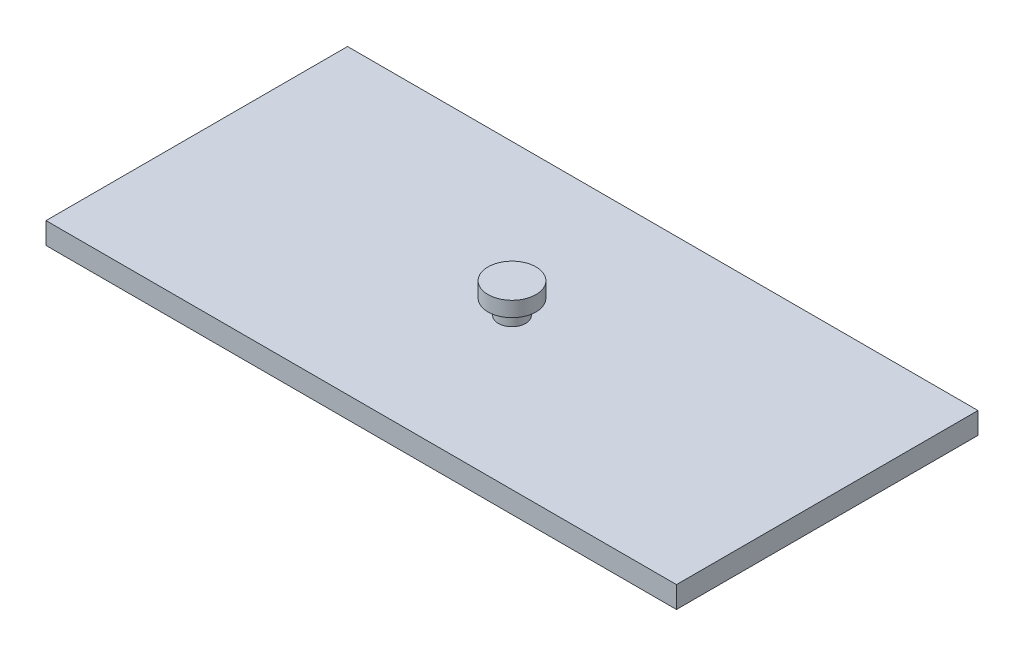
ISO-10303-21;
HEADER;
FILE_DESCRIPTION(('STEP AP214'),'2;1');
FILE_NAME('part.step','',(''),(''),'','','');
FILE_SCHEMA(('AUTOMOTIVE_DESIGN { 1 0 10303 214 1 1 1 1 }'));
ENDSEC;
DATA;
#1=APPLICATION_CONTEXT('core data for automotive mechanical design processes');
#2=APPLICATION_PROTOCOL_DEFINITION('international standard','automotive_design',2000,#1);
#3=PRODUCT_CONTEXT('',#1,'mechanical');
#4=PRODUCT('Part','Part','',(#3));
#5=PRODUCT_RELATED_PRODUCT_CATEGORY('part','',(#4));
#6=PRODUCT_DEFINITION_FORMATION('','',#4);
#7=PRODUCT_DEFINITION_CONTEXT('part definition',#1,'design');
#8=PRODUCT_DEFINITION('design','',#6,#7);
#9=PRODUCT_DEFINITION_SHAPE('','',#8);
#10=(LENGTH_UNIT() NAMED_UNIT(*) SI_UNIT(.MILLI.,.METRE.));
#11=(NAMED_UNIT(*) PLANE_ANGLE_UNIT() SI_UNIT($,.RADIAN.));
#12=(NAMED_UNIT(*) SI_UNIT($,.STERADIAN.) SOLID_ANGLE_UNIT());
#13=UNCERTAINTY_MEASURE_WITH_UNIT(LENGTH_MEASURE(1.E-05),#10,'distance_accuracy_value','');
#14=(GEOMETRIC_REPRESENTATION_CONTEXT(3) GLOBAL_UNCERTAINTY_ASSIGNED_CONTEXT((#13)) GLOBAL_UNIT_ASSIGNED_CONTEXT((#10,
#11,#12)) REPRESENTATION_CONTEXT('',''));
#15=CARTESIAN_POINT('',(0.,0.,0.));
#16=DIRECTION('',(0.,0.,1.));
#17=DIRECTION('',(1.,0.,0.));
#18=AXIS2_PLACEMENT_3D('',#15,#16,#17);
#19=CARTESIAN_POINT('',(0.,0.,0.));
#20=DIRECTION('',(0.,1.,0.));
#21=DIRECTION('',(0.,0.,1.));
#22=AXIS2_PLACEMENT_3D('',#19,#20,#21);
#23=PLANE('',#22);
#24=DIRECTION('',(0.,0.,1.));
#25=VECTOR('',#24,1.);
#26=CARTESIAN_POINT('',(-45.466,0.,25.146));
#27=LINE('',#26,#25);
#28=CARTESIAN_POINT('',(-45.466,0.,14.986));
#29=VERTEX_POINT('',#28);
#30=CARTESIAN_POINT('',(-45.466,0.,25.146));
#31=VERTEX_POINT('',#30);
#32=EDGE_CURVE('E262',#29,#31,#27,.T.);
#33=ORIENTED_EDGE('',*,*,#32,.F.);
#34=DIRECTION('',(1.,0.,0.));
#35=VECTOR('',#34,1.);
#36=CARTESIAN_POINT('',(-55.626,0.,14.986));
#37=LINE('',#36,#35);
#38=CARTESIAN_POINT('',(-55.626,0.,14.986));
#39=VERTEX_POINT('',#38);
#40=EDGE_CURVE('E267',#39,#29,#37,.T.);
#41=ORIENTED_EDGE('',*,*,#40,.F.);
#42=DIRECTION('',(0.,0.,-1.));
#43=VECTOR('',#42,1.);
#44=CARTESIAN_POINT('',(-55.626,0.,25.146));
#45=LINE('',#44,#43);
#46=CARTESIAN_POINT('',(-55.626,0.,25.146));
#47=VERTEX_POINT('',#46);
#48=EDGE_CURVE('E279',#47,#39,#45,.T.);
#49=ORIENTED_EDGE('',*,*,#48,.F.);
#50=DIRECTION('',(-1.,0.,0.));
#51=VECTOR('',#50,1.);
#52=CARTESIAN_POINT('',(-55.626,0.,25.146));
#53=LINE('',#52,#51);
#54=EDGE_CURVE('E276',#31,#47,#53,.T.);
#55=ORIENTED_EDGE('',*,*,#54,.F.);
#56=EDGE_LOOP('',(#33,#41,#49,#55));
#57=FACE_BOUND('',#56,.T.);
#58=DIRECTION('',(0.,0.,-1.));
#59=VECTOR('',#58,1.);
#60=CARTESIAN_POINT('',(58.42,0.,-27.94));
#61=LINE('',#60,#59);
#62=CARTESIAN_POINT('',(58.42,0.,27.94));
#63=VERTEX_POINT('',#62);
#64=CARTESIAN_POINT('',(58.42,0.,-27.94));
#65=VERTEX_POINT('',#64);
#66=EDGE_CURVE('E305',#63,#65,#61,.T.);
#67=ORIENTED_EDGE('',*,*,#66,.F.);
#68=DIRECTION('',(1.,0.,0.));
#69=VECTOR('',#68,1.);
#70=CARTESIAN_POINT('',(-58.42,0.,27.94));
#71=LINE('',#70,#69);
#72=CARTESIAN_POINT('',(-58.42,0.,27.94));
#73=VERTEX_POINT('',#72);
#74=EDGE_CURVE('E312',#73,#63,#71,.T.);
#75=ORIENTED_EDGE('',*,*,#74,.F.);
#76=DIRECTION('',(0.,0.,1.));
#77=VECTOR('',#76,1.);
#78=CARTESIAN_POINT('',(-58.42,0.,-27.94));
#79=LINE('',#78,#77);
#80=CARTESIAN_POINT('',(-58.42,0.,-27.94));
#81=VERTEX_POINT('',#80);
#82=EDGE_CURVE('E323',#81,#73,#79,.T.);
#83=ORIENTED_EDGE('',*,*,#82,.F.);
#84=DIRECTION('',(-1.,0.,0.));
#85=VECTOR('',#84,1.);
#86=CARTESIAN_POINT('',(-58.42,0.,-27.94));
#87=LINE('',#86,#85);
#88=EDGE_CURVE('E321',#65,#81,#87,.T.);
#89=ORIENTED_EDGE('',*,*,#88,.F.);
#90=EDGE_LOOP('',(#67,#75,#83,#89));
#91=FACE_BOUND('',#90,.T.);
#92=DIRECTION('',(-1.,0.,0.));
#93=VECTOR('',#92,1.);
#94=CARTESIAN_POINT('',(55.626,0.,14.986));
#95=LINE('',#94,#93);
#96=CARTESIAN_POINT('',(55.626,0.,14.986));
#97=VERTEX_POINT('',#96);
#98=CARTESIAN_POINT('',(45.466,0.,14.986));
#99=VERTEX_POINT('',#98);
#100=EDGE_CURVE('E246',#97,#99,#95,.T.);
#101=ORIENTED_EDGE('',*,*,#100,.T.);
#102=DIRECTION('',(0.,0.,1.));
#103=VECTOR('',#102,1.);
#104=CARTESIAN_POINT('',(45.466,0.,25.146));
#105=LINE('',#104,#103);
#106=CARTESIAN_POINT('',(45.466,0.,25.146));
#107=VERTEX_POINT('',#106);
#108=EDGE_CURVE('E229',#99,#107,#105,.T.);
#109=ORIENTED_EDGE('',*,*,#108,.T.);
#110=DIRECTION('',(1.,0.,0.));
#111=VECTOR('',#110,1.);
#112=CARTESIAN_POINT('',(55.626,0.,25.146));
#113=LINE('',#112,#111);
#114=CARTESIAN_POINT('',(55.626,0.,25.146));
#115=VERTEX_POINT('',#114);
#116=EDGE_CURVE('E234',#107,#115,#113,.T.);
#117=ORIENTED_EDGE('',*,*,#116,.T.);
#118=DIRECTION('',(0.,0.,-1.));
#119=VECTOR('',#118,1.);
#120=CARTESIAN_POINT('',(55.626,0.,25.146));
#121=LINE('',#120,#119);
#122=EDGE_CURVE('E249',#115,#97,#121,.T.);
#123=ORIENTED_EDGE('',*,*,#122,.T.);
#124=EDGE_LOOP('',(#101,#109,#117,#123));
#125=FACE_BOUND('',#124,.T.);
#126=DIRECTION('',(1.,0.,0.));
#127=VECTOR('',#126,1.);
#128=CARTESIAN_POINT('',(-55.626,0.,-14.986));
#129=LINE('',#128,#127);
#130=CARTESIAN_POINT('',(-55.626,0.,-14.986));
#131=VERTEX_POINT('',#130);
#132=CARTESIAN_POINT('',(-45.466,0.,-14.986));
#133=VERTEX_POINT('',#132);
#134=EDGE_CURVE('E194',#131,#133,#129,.T.);
#135=ORIENTED_EDGE('',*,*,#134,.T.);
#136=DIRECTION('',(0.,0.,-1.));
#137=VECTOR('',#136,1.);
#138=CARTESIAN_POINT('',(-45.466,0.,-25.146));
#139=LINE('',#138,#137);
#140=CARTESIAN_POINT('',(-45.466,0.,-25.146));
#141=VERTEX_POINT('',#140);
#142=EDGE_CURVE('E191',#133,#141,#139,.T.);
#143=ORIENTED_EDGE('',*,*,#142,.T.);
#144=DIRECTION('',(-1.,0.,0.));
#145=VECTOR('',#144,1.);
#146=CARTESIAN_POINT('',(-55.626,0.,-25.146));
#147=LINE('',#146,#145);
#148=CARTESIAN_POINT('',(-55.626,0.,-25.146));
#149=VERTEX_POINT('',#148);
#150=EDGE_CURVE('E204',#141,#149,#147,.T.);
#151=ORIENTED_EDGE('',*,*,#150,.T.);
#152=DIRECTION('',(0.,0.,1.));
#153=VECTOR('',#152,1.);
#154=CARTESIAN_POINT('',(-55.626,0.,-25.146));
#155=LINE('',#154,#153);
#156=EDGE_CURVE('E216',#149,#131,#155,.T.);
#157=ORIENTED_EDGE('',*,*,#156,.T.);
#158=EDGE_LOOP('',(#135,#143,#151,#157));
#159=FACE_BOUND('',#158,.T.);
#160=DIRECTION('',(0.,0.,-1.));
#161=VECTOR('',#160,1.);
#162=CARTESIAN_POINT('',(45.466,0.,-25.146));
#163=LINE('',#162,#161);
#164=CARTESIAN_POINT('',(45.466,0.,-14.986));
#165=VERTEX_POINT('',#164);
#166=CARTESIAN_POINT('',(45.466,0.,-25.146));
#167=VERTEX_POINT('',#166);
#168=EDGE_CURVE('E190',#165,#167,#163,.T.);
#169=ORIENTED_EDGE('',*,*,#168,.F.);
#170=DIRECTION('',(-1.,0.,0.));
#171=VECTOR('',#170,1.);
#172=CARTESIAN_POINT('',(55.626,0.,-14.986));
#173=LINE('',#172,#171);
#174=CARTESIAN_POINT('',(55.626,0.,-14.986));
#175=VERTEX_POINT('',#174);
#176=EDGE_CURVE('E187',#175,#165,#173,.T.);
#177=ORIENTED_EDGE('',*,*,#176,.F.);
#178=DIRECTION('',(0.,0.,1.));
#179=VECTOR('',#178,1.);
#180=CARTESIAN_POINT('',(55.626,0.,-25.146));
#181=LINE('',#180,#179);
#182=CARTESIAN_POINT('',(55.626,0.,-25.146));
#183=VERTEX_POINT('',#182);
#184=EDGE_CURVE('E53',#183,#175,#181,.T.);
#185=ORIENTED_EDGE('',*,*,#184,.F.);
#186=DIRECTION('',(1.,0.,0.));
#187=VECTOR('',#186,1.);
#188=CARTESIAN_POINT('',(55.626,0.,-25.146));
#189=LINE('',#188,#187);
#190=EDGE_CURVE('E48',#167,#183,#189,.T.);
#191=ORIENTED_EDGE('',*,*,#190,.F.);
#192=EDGE_LOOP('',(#169,#177,#185,#191));
#193=FACE_BOUND('',#192,.T.);
#194=ADVANCED_FACE('F33',(#57,#91,#125,#159,#193),#23,.F.);
#195=CARTESIAN_POINT('',(58.42,3.999992,-27.94));
#196=DIRECTION('',(-1.,0.,0.));
#197=DIRECTION('',(0.,0.,1.));
#198=AXIS2_PLACEMENT_3D('',#195,#196,#197);
#199=PLANE('',#198);
#200=ORIENTED_EDGE('',*,*,#66,.T.);
#201=DIRECTION('',(0.,-1.,0.));
#202=VECTOR('',#201,1.);
#203=CARTESIAN_POINT('',(58.42,3.999992,-27.94));
#204=LINE('',#203,#202);
#205=CARTESIAN_POINT('',(58.42,3.999992,-27.94));
#206=VERTEX_POINT('',#205);
#207=EDGE_CURVE('E11',#206,#65,#204,.T.);
#208=ORIENTED_EDGE('',*,*,#207,.F.);
#209=DIRECTION('',(0.,0.,-1.));
#210=VECTOR('',#209,1.);
#211=CARTESIAN_POINT('',(58.42,3.999992,-27.94));
#212=LINE('',#211,#210);
#213=CARTESIAN_POINT('',(58.42,3.999992,27.94));
#214=VERTEX_POINT('',#213);
#215=EDGE_CURVE('E308',#214,#206,#212,.T.);
#216=ORIENTED_EDGE('',*,*,#215,.F.);
#217=DIRECTION('',(0.,-1.,0.));
#218=VECTOR('',#217,1.);
#219=CARTESIAN_POINT('',(58.42,3.999992,27.94));
#220=LINE('',#219,#218);
#221=EDGE_CURVE('E318',#214,#63,#220,.T.);
#222=ORIENTED_EDGE('',*,*,#221,.T.);
#223=EDGE_LOOP('',(#200,#208,#216,#222));
#224=FACE_BOUND('',#223,.T.);
#225=ADVANCED_FACE('F35',(#224),#199,.F.);
#226=CARTESIAN_POINT('',(-58.42,3.999992,-27.94));
#227=DIRECTION('',(0.,0.,1.));
#228=DIRECTION('',(1.,0.,0.));
#229=AXIS2_PLACEMENT_3D('',#226,#227,#228);
#230=PLANE('',#229);
#231=ORIENTED_EDGE('',*,*,#88,.T.);
#232=DIRECTION('',(0.,-1.,0.));
#233=VECTOR('',#232,1.);
#234=CARTESIAN_POINT('',(-58.42,3.999992,-27.94));
#235=LINE('',#234,#233);
#236=CARTESIAN_POINT('',(-58.42,3.999992,-27.94));
#237=VERTEX_POINT('',#236);
#238=EDGE_CURVE('E41',#237,#81,#235,.T.);
#239=ORIENTED_EDGE('',*,*,#238,.F.);
#240=DIRECTION('',(-1.,0.,0.));
#241=VECTOR('',#240,1.);
#242=CARTESIAN_POINT('',(-58.42,3.999992,-27.94));
#243=LINE('',#242,#241);
#244=EDGE_CURVE('E311',#206,#237,#243,.T.);
#245=ORIENTED_EDGE('',*,*,#244,.F.);
#246=ORIENTED_EDGE('',*,*,#207,.T.);
#247=EDGE_LOOP('',(#231,#239,#245,#246));
#248=FACE_BOUND('',#247,.T.);
#249=ADVANCED_FACE('F351',(#248),#230,.F.);
#250=CARTESIAN_POINT('',(-58.42,3.999992,-27.94));
#251=DIRECTION('',(1.,0.,0.));
#252=DIRECTION('',(0.,0.,-1.));
#253=AXIS2_PLACEMENT_3D('',#250,#251,#252);
#254=PLANE('',#253);
#255=ORIENTED_EDGE('',*,*,#82,.T.);
#256=DIRECTION('',(0.,-1.,0.));
#257=VECTOR('',#256,1.);
#258=CARTESIAN_POINT('',(-58.42,3.999992,27.94));
#259=LINE('',#258,#257);
#260=CARTESIAN_POINT('',(-58.42,3.999992,27.94));
#261=VERTEX_POINT('',#260);
#262=EDGE_CURVE('E328',#261,#73,#259,.T.);
#263=ORIENTED_EDGE('',*,*,#262,.F.);
#264=DIRECTION('',(0.,0.,1.));
#265=VECTOR('',#264,1.);
#266=CARTESIAN_POINT('',(-58.42,3.999992,-27.94));
#267=LINE('',#266,#265);
#268=EDGE_CURVE('E314',#237,#261,#267,.T.);
#269=ORIENTED_EDGE('',*,*,#268,.F.);
#270=ORIENTED_EDGE('',*,*,#238,.T.);
#271=EDGE_LOOP('',(#255,#263,#269,#270));
#272=FACE_BOUND('',#271,.T.);
#273=ADVANCED_FACE('F335',(#272),#254,.F.);
#274=CARTESIAN_POINT('',(-58.42,3.999992,27.94));
#275=DIRECTION('',(0.,0.,-1.));
#276=DIRECTION('',(-1.,0.,0.));
#277=AXIS2_PLACEMENT_3D('',#274,#275,#276);
#278=PLANE('',#277);
#279=ORIENTED_EDGE('',*,*,#74,.T.);
#280=ORIENTED_EDGE('',*,*,#221,.F.);
#281=DIRECTION('',(1.,0.,0.));
#282=VECTOR('',#281,1.);
#283=CARTESIAN_POINT('',(-58.42,3.999992,27.94));
#284=LINE('',#283,#282);
#285=EDGE_CURVE('E316',#261,#214,#284,.T.);
#286=ORIENTED_EDGE('',*,*,#285,.F.);
#287=ORIENTED_EDGE('',*,*,#262,.T.);
#288=EDGE_LOOP('',(#279,#280,#286,#287));
#289=FACE_BOUND('',#288,.T.);
#290=ADVANCED_FACE('F344',(#289),#278,.F.);
#291=CARTESIAN_POINT('',(0.,3.999992,0.));
#292=DIRECTION('',(0.,1.,0.));
#293=DIRECTION('',(0.,0.,1.));
#294=AXIS2_PLACEMENT_3D('',#291,#292,#293);
#295=PLANE('',#294);
#296=CARTESIAN_POINT('',(0.,3.999992,0.));
#297=DIRECTION('',(0.,1.,0.));
#298=DIRECTION('',(0.,0.,1.));
#299=AXIS2_PLACEMENT_3D('',#296,#297,#298);
#300=CIRCLE('',#299,2.54);
#301=CARTESIAN_POINT('',(0.,3.999992,2.54));
#302=VERTEX_POINT('',#301);
#303=EDGE_CURVE('E299',#302,#302,#300,.T.);
#304=ORIENTED_EDGE('',*,*,#303,.F.);
#305=EDGE_LOOP('',(#304));
#306=FACE_BOUND('',#305,.T.);
#307=ORIENTED_EDGE('',*,*,#215,.T.);
#308=ORIENTED_EDGE('',*,*,#244,.T.);
#309=ORIENTED_EDGE('',*,*,#268,.T.);
#310=ORIENTED_EDGE('',*,*,#285,.T.);
#311=EDGE_LOOP('',(#307,#308,#309,#310));
#312=FACE_BOUND('',#311,.T.);
#313=ADVANCED_FACE('F350',(#306,#312),#295,.T.);
#314=CARTESIAN_POINT('',(0.,6.793992,0.));
#315=DIRECTION('',(0.,-1.,0.));
#316=DIRECTION('',(0.,0.,-1.));
#317=AXIS2_PLACEMENT_3D('',#314,#315,#316);
#318=CYLINDRICAL_SURFACE('',#317,2.54);
#319=CARTESIAN_POINT('',(0.,6.793992,0.));
#320=DIRECTION('',(0.,1.,0.));
#321=DIRECTION('',(0.,0.,1.));
#322=AXIS2_PLACEMENT_3D('',#319,#320,#321);
#323=CIRCLE('',#322,2.54);
#324=CARTESIAN_POINT('',(0.,6.793992,2.54));
#325=VERTEX_POINT('',#324);
#326=EDGE_CURVE('E302',#325,#325,#323,.T.);
#327=ORIENTED_EDGE('',*,*,#326,.F.);
#328=EDGE_LOOP('',(#327));
#329=FACE_BOUND('',#328,.T.);
#330=ORIENTED_EDGE('',*,*,#303,.T.);
#331=EDGE_LOOP('',(#330));
#332=FACE_BOUND('',#331,.T.);
#333=ADVANCED_FACE('F370',(#329,#332),#318,.T.);
#334=CARTESIAN_POINT('',(0.,9.587992,0.));
#335=DIRECTION('',(0.,-1.,0.));
#336=DIRECTION('',(0.,0.,-1.));
#337=AXIS2_PLACEMENT_3D('',#334,#335,#336);
#338=CYLINDRICAL_SURFACE('',#337,4.445);
#339=CARTESIAN_POINT('',(0.,9.587992,0.));
#340=DIRECTION('',(0.,1.,0.));
#341=DIRECTION('',(0.,0.,1.));
#342=AXIS2_PLACEMENT_3D('',#339,#340,#341);
#343=CIRCLE('',#342,4.445);
#344=CARTESIAN_POINT('',(0.,9.587992,4.445));
#345=VERTEX_POINT('',#344);
#346=EDGE_CURVE('E296',#345,#345,#343,.T.);
#347=ORIENTED_EDGE('',*,*,#346,.F.);
#348=EDGE_LOOP('',(#347));
#349=FACE_BOUND('',#348,.T.);
#350=CARTESIAN_POINT('',(0.,6.793992,0.));
#351=DIRECTION('',(0.,1.,0.));
#352=DIRECTION('',(0.,0.,1.));
#353=AXIS2_PLACEMENT_3D('',#350,#351,#352);
#354=CIRCLE('',#353,4.445);
#355=CARTESIAN_POINT('',(0.,6.793992,4.445));
#356=VERTEX_POINT('',#355);
#357=EDGE_CURVE('E295',#356,#356,#354,.T.);
#358=ORIENTED_EDGE('',*,*,#357,.T.);
#359=EDGE_LOOP('',(#358));
#360=FACE_BOUND('',#359,.T.);
#361=ADVANCED_FACE('F375',(#349,#360),#338,.T.);
#362=CARTESIAN_POINT('',(0.,9.587992,0.));
#363=DIRECTION('',(0.,1.,0.));
#364=DIRECTION('',(0.,0.,1.));
#365=AXIS2_PLACEMENT_3D('',#362,#363,#364);
#366=PLANE('',#365);
#367=ORIENTED_EDGE('',*,*,#346,.T.);
#368=EDGE_LOOP('',(#367));
#369=FACE_BOUND('',#368,.T.);
#370=ADVANCED_FACE('F382',(#369),#366,.T.);
#371=CARTESIAN_POINT('',(0.,6.793992,0.));
#372=DIRECTION('',(0.,1.,0.));
#373=DIRECTION('',(0.,0.,1.));
#374=AXIS2_PLACEMENT_3D('',#371,#372,#373);
#375=PLANE('',#374);
#376=ORIENTED_EDGE('',*,*,#326,.T.);
#377=EDGE_LOOP('',(#376));
#378=FACE_BOUND('',#377,.T.);
#379=ORIENTED_EDGE('',*,*,#357,.F.);
#380=EDGE_LOOP('',(#379));
#381=FACE_BOUND('',#380,.T.);
#382=ADVANCED_FACE('F387',(#378,#381),#375,.F.);
#383=CARTESIAN_POINT('',(-45.466,-2.794,25.146));
#384=DIRECTION('',(-1.,0.,0.));
#385=DIRECTION('',(0.,0.,1.));
#386=AXIS2_PLACEMENT_3D('',#383,#384,#385);
#387=PLANE('',#386);
#388=ORIENTED_EDGE('',*,*,#32,.T.);
#389=DIRECTION('',(0.,1.,0.));
#390=VECTOR('',#389,1.);
#391=CARTESIAN_POINT('',(-45.466,-2.794,25.146));
#392=LINE('',#391,#390);
#393=CARTESIAN_POINT('',(-45.466,-2.794,25.146));
#394=VERTEX_POINT('',#393);
#395=EDGE_CURVE('E292',#394,#31,#392,.T.);
#396=ORIENTED_EDGE('',*,*,#395,.F.);
#397=DIRECTION('',(0.,0.,1.));
#398=VECTOR('',#397,1.);
#399=CARTESIAN_POINT('',(-45.466,-2.794,25.146));
#400=LINE('',#399,#398);
#401=CARTESIAN_POINT('',(-45.466,-2.794,14.986));
#402=VERTEX_POINT('',#401);
#403=EDGE_CURVE('E263',#402,#394,#400,.T.);
#404=ORIENTED_EDGE('',*,*,#403,.F.);
#405=DIRECTION('',(0.,1.,0.));
#406=VECTOR('',#405,1.);
#407=CARTESIAN_POINT('',(-45.466,-2.794,14.986));
#408=LINE('',#407,#406);
#409=EDGE_CURVE('E273',#402,#29,#408,.T.);
#410=ORIENTED_EDGE('',*,*,#409,.T.);
#411=EDGE_LOOP('',(#388,#396,#404,#410));
#412=FACE_BOUND('',#411,.T.);
#413=ADVANCED_FACE('F390',(#412),#387,.F.);
#414=CARTESIAN_POINT('',(-55.626,-2.794,25.146));
#415=DIRECTION('',(0.,0.,-1.));
#416=DIRECTION('',(-1.,0.,0.));
#417=AXIS2_PLACEMENT_3D('',#414,#415,#416);
#418=PLANE('',#417);
#419=ORIENTED_EDGE('',*,*,#54,.T.);
#420=DIRECTION('',(0.,1.,0.));
#421=VECTOR('',#420,1.);
#422=CARTESIAN_POINT('',(-55.626,-2.794,25.146));
#423=LINE('',#422,#421);
#424=CARTESIAN_POINT('',(-55.626,-2.794,25.146));
#425=VERTEX_POINT('',#424);
#426=EDGE_CURVE('E289',#425,#47,#423,.T.);
#427=ORIENTED_EDGE('',*,*,#426,.F.);
#428=DIRECTION('',(-1.,0.,0.));
#429=VECTOR('',#428,1.);
#430=CARTESIAN_POINT('',(-55.626,-2.794,25.146));
#431=LINE('',#430,#429);
#432=EDGE_CURVE('E266',#394,#425,#431,.T.);
#433=ORIENTED_EDGE('',*,*,#432,.F.);
#434=ORIENTED_EDGE('',*,*,#395,.T.);
#435=EDGE_LOOP('',(#419,#427,#433,#434));
#436=FACE_BOUND('',#435,.T.);
#437=ADVANCED_FACE('F397',(#436),#418,.F.);
#438=CARTESIAN_POINT('',(-55.626,-2.794,25.146));
#439=DIRECTION('',(1.,0.,0.));
#440=DIRECTION('',(0.,0.,-1.));
#441=AXIS2_PLACEMENT_3D('',#438,#439,#440);
#442=PLANE('',#441);
#443=ORIENTED_EDGE('',*,*,#48,.T.);
#444=DIRECTION('',(0.,1.,0.));
#445=VECTOR('',#444,1.);
#446=CARTESIAN_POINT('',(-55.626,-2.794,14.986));
#447=LINE('',#446,#445);
#448=CARTESIAN_POINT('',(-55.626,-2.794,14.986));
#449=VERTEX_POINT('',#448);
#450=EDGE_CURVE('E286',#449,#39,#447,.T.);
#451=ORIENTED_EDGE('',*,*,#450,.F.);
#452=DIRECTION('',(0.,0.,-1.));
#453=VECTOR('',#452,1.);
#454=CARTESIAN_POINT('',(-55.626,-2.794,25.146));
#455=LINE('',#454,#453);
#456=EDGE_CURVE('E269',#425,#449,#455,.T.);
#457=ORIENTED_EDGE('',*,*,#456,.F.);
#458=ORIENTED_EDGE('',*,*,#426,.T.);
#459=EDGE_LOOP('',(#443,#451,#457,#458));
#460=FACE_BOUND('',#459,.T.);
#461=ADVANCED_FACE('F401',(#460),#442,.F.);
#462=CARTESIAN_POINT('',(-55.626,-2.794,14.986));
#463=DIRECTION('',(0.,0.,1.));
#464=DIRECTION('',(1.,0.,0.));
#465=AXIS2_PLACEMENT_3D('',#462,#463,#464);
#466=PLANE('',#465);
#467=ORIENTED_EDGE('',*,*,#40,.T.);
#468=ORIENTED_EDGE('',*,*,#409,.F.);
#469=DIRECTION('',(1.,0.,0.));
#470=VECTOR('',#469,1.);
#471=CARTESIAN_POINT('',(-55.626,-2.794,14.986));
#472=LINE('',#471,#470);
#473=EDGE_CURVE('E271',#449,#402,#472,.T.);
#474=ORIENTED_EDGE('',*,*,#473,.F.);
#475=ORIENTED_EDGE('',*,*,#450,.T.);
#476=EDGE_LOOP('',(#467,#468,#474,#475));
#477=FACE_BOUND('',#476,.T.);
#478=ADVANCED_FACE('F405',(#477),#466,.F.);
#479=CARTESIAN_POINT('',(0.,-2.794,0.));
#480=DIRECTION('',(0.,-1.,0.));
#481=DIRECTION('',(0.,0.,-1.));
#482=AXIS2_PLACEMENT_3D('',#479,#480,#481);
#483=PLANE('',#482);
#484=ORIENTED_EDGE('',*,*,#403,.T.);
#485=ORIENTED_EDGE('',*,*,#432,.T.);
#486=ORIENTED_EDGE('',*,*,#456,.T.);
#487=ORIENTED_EDGE('',*,*,#473,.T.);
#488=EDGE_LOOP('',(#484,#485,#486,#487));
#489=FACE_BOUND('',#488,.T.);
#490=ADVANCED_FACE('F409',(#489),#483,.T.);
#491=CARTESIAN_POINT('',(45.466,-2.794,25.146));
#492=DIRECTION('',(-1.,0.,0.));
#493=DIRECTION('',(0.,0.,1.));
#494=AXIS2_PLACEMENT_3D('',#491,#492,#493);
#495=PLANE('',#494);
#496=ORIENTED_EDGE('',*,*,#108,.F.);
#497=DIRECTION('',(0.,1.,0.));
#498=VECTOR('',#497,1.);
#499=CARTESIAN_POINT('',(45.466,-2.794,14.986));
#500=LINE('',#499,#498);
#501=CARTESIAN_POINT('',(45.466,-2.794,14.986));
#502=VERTEX_POINT('',#501);
#503=EDGE_CURVE('E260',#502,#99,#500,.T.);
#504=ORIENTED_EDGE('',*,*,#503,.F.);
#505=DIRECTION('',(0.,0.,1.));
#506=VECTOR('',#505,1.);
#507=CARTESIAN_POINT('',(45.466,-2.794,25.146));
#508=LINE('',#507,#506);
#509=CARTESIAN_POINT('',(45.466,-2.794,25.146));
#510=VERTEX_POINT('',#509);
#511=EDGE_CURVE('E230',#502,#510,#508,.T.);
#512=ORIENTED_EDGE('',*,*,#511,.T.);
#513=DIRECTION('',(0.,1.,0.));
#514=VECTOR('',#513,1.);
#515=CARTESIAN_POINT('',(45.466,-2.794,25.146));
#516=LINE('',#515,#514);
#517=EDGE_CURVE('E243',#510,#107,#516,.T.);
#518=ORIENTED_EDGE('',*,*,#517,.T.);
#519=EDGE_LOOP('',(#496,#504,#512,#518));
#520=FACE_BOUND('',#519,.T.);
#521=ADVANCED_FACE('F413',(#520),#495,.T.);
#522=CARTESIAN_POINT('',(55.626,-2.794,14.986));
#523=DIRECTION('',(0.,0.,-1.));
#524=DIRECTION('',(-1.,0.,0.));
#525=AXIS2_PLACEMENT_3D('',#522,#523,#524);
#526=PLANE('',#525);
#527=ORIENTED_EDGE('',*,*,#100,.F.);
#528=DIRECTION('',(0.,1.,0.));
#529=VECTOR('',#528,1.);
#530=CARTESIAN_POINT('',(55.626,-2.794,14.986));
#531=LINE('',#530,#529);
#532=CARTESIAN_POINT('',(55.626,-2.794,14.986));
#533=VERTEX_POINT('',#532);
#534=EDGE_CURVE('E258',#533,#97,#531,.T.);
#535=ORIENTED_EDGE('',*,*,#534,.F.);
#536=DIRECTION('',(-1.,0.,0.));
#537=VECTOR('',#536,1.);
#538=CARTESIAN_POINT('',(55.626,-2.794,14.986));
#539=LINE('',#538,#537);
#540=EDGE_CURVE('E233',#533,#502,#539,.T.);
#541=ORIENTED_EDGE('',*,*,#540,.T.);
#542=ORIENTED_EDGE('',*,*,#503,.T.);
#543=EDGE_LOOP('',(#527,#535,#541,#542));
#544=FACE_BOUND('',#543,.T.);
#545=ADVANCED_FACE('F417',(#544),#526,.T.);
#546=CARTESIAN_POINT('',(55.626,-2.794,25.146));
#547=DIRECTION('',(1.,0.,0.));
#548=DIRECTION('',(0.,0.,-1.));
#549=AXIS2_PLACEMENT_3D('',#546,#547,#548);
#550=PLANE('',#549);
#551=ORIENTED_EDGE('',*,*,#122,.F.);
#552=DIRECTION('',(0.,1.,0.));
#553=VECTOR('',#552,1.);
#554=CARTESIAN_POINT('',(55.626,-2.794,25.146));
#555=LINE('',#554,#553);
#556=CARTESIAN_POINT('',(55.626,-2.794,25.146));
#557=VERTEX_POINT('',#556);
#558=EDGE_CURVE('E255',#557,#115,#555,.T.);
#559=ORIENTED_EDGE('',*,*,#558,.F.);
#560=DIRECTION('',(0.,0.,-1.));
#561=VECTOR('',#560,1.);
#562=CARTESIAN_POINT('',(55.626,-2.794,25.146));
#563=LINE('',#562,#561);
#564=EDGE_CURVE('E237',#557,#533,#563,.T.);
#565=ORIENTED_EDGE('',*,*,#564,.T.);
#566=ORIENTED_EDGE('',*,*,#534,.T.);
#567=EDGE_LOOP('',(#551,#559,#565,#566));
#568=FACE_BOUND('',#567,.T.);
#569=ADVANCED_FACE('F421',(#568),#550,.T.);
#570=CARTESIAN_POINT('',(55.626,-2.794,25.146));
#571=DIRECTION('',(0.,0.,1.));
#572=DIRECTION('',(1.,0.,0.));
#573=AXIS2_PLACEMENT_3D('',#570,#571,#572);
#574=PLANE('',#573);
#575=ORIENTED_EDGE('',*,*,#116,.F.);
#576=ORIENTED_EDGE('',*,*,#517,.F.);
#577=DIRECTION('',(1.,0.,0.));
#578=VECTOR('',#577,1.);
#579=CARTESIAN_POINT('',(55.626,-2.794,25.146));
#580=LINE('',#579,#578);
#581=EDGE_CURVE('E240',#510,#557,#580,.T.);
#582=ORIENTED_EDGE('',*,*,#581,.T.);
#583=ORIENTED_EDGE('',*,*,#558,.T.);
#584=EDGE_LOOP('',(#575,#576,#582,#583));
#585=FACE_BOUND('',#584,.T.);
#586=ADVANCED_FACE('F425',(#585),#574,.T.);
#587=CARTESIAN_POINT('',(0.,-2.794,0.));
#588=DIRECTION('',(0.,-1.,0.));
#589=DIRECTION('',(0.,0.,-1.));
#590=AXIS2_PLACEMENT_3D('',#587,#588,#589);
#591=PLANE('',#590);
#592=ORIENTED_EDGE('',*,*,#511,.F.);
#593=ORIENTED_EDGE('',*,*,#540,.F.);
#594=ORIENTED_EDGE('',*,*,#564,.F.);
#595=ORIENTED_EDGE('',*,*,#581,.F.);
#596=EDGE_LOOP('',(#592,#593,#594,#595));
#597=FACE_BOUND('',#596,.T.);
#598=ADVANCED_FACE('F429',(#597),#591,.T.);
#599=CARTESIAN_POINT('',(-45.466,-2.794,-25.146));
#600=DIRECTION('',(1.,0.,0.));
#601=DIRECTION('',(0.,0.,-1.));
#602=AXIS2_PLACEMENT_3D('',#599,#600,#601);
#603=PLANE('',#602);
#604=ORIENTED_EDGE('',*,*,#142,.F.);
#605=DIRECTION('',(0.,1.,0.));
#606=VECTOR('',#605,1.);
#607=CARTESIAN_POINT('',(-45.466,-2.794,-14.986));
#608=LINE('',#607,#606);
#609=CARTESIAN_POINT('',(-45.466,-2.794,-14.986));
#610=VERTEX_POINT('',#609);
#611=EDGE_CURVE('E227',#610,#133,#608,.T.);
#612=ORIENTED_EDGE('',*,*,#611,.F.);
#613=DIRECTION('',(0.,0.,-1.));
#614=VECTOR('',#613,1.);
#615=CARTESIAN_POINT('',(-45.466,-2.794,-25.146));
#616=LINE('',#615,#614);
#617=CARTESIAN_POINT('',(-45.466,-2.794,-25.146));
#618=VERTEX_POINT('',#617);
#619=EDGE_CURVE('E200',#610,#618,#616,.T.);
#620=ORIENTED_EDGE('',*,*,#619,.T.);
#621=DIRECTION('',(0.,1.,0.));
#622=VECTOR('',#621,1.);
#623=CARTESIAN_POINT('',(-45.466,-2.794,-25.146));
#624=LINE('',#623,#622);
#625=EDGE_CURVE('E212',#618,#141,#624,.T.);
#626=ORIENTED_EDGE('',*,*,#625,.T.);
#627=EDGE_LOOP('',(#604,#612,#620,#626));
#628=FACE_BOUND('',#627,.T.);
#629=ADVANCED_FACE('F433',(#628),#603,.T.);
#630=CARTESIAN_POINT('',(-55.626,-2.794,-14.986));
#631=DIRECTION('',(0.,0.,1.));
#632=DIRECTION('',(1.,0.,0.));
#633=AXIS2_PLACEMENT_3D('',#630,#631,#632);
#634=PLANE('',#633);
#635=ORIENTED_EDGE('',*,*,#134,.F.);
#636=DIRECTION('',(0.,1.,0.));
#637=VECTOR('',#636,1.);
#638=CARTESIAN_POINT('',(-55.626,-2.794,-14.986));
#639=LINE('',#638,#637);
#640=CARTESIAN_POINT('',(-55.626,-2.794,-14.986));
#641=VERTEX_POINT('',#640);
#642=EDGE_CURVE('E225',#641,#131,#639,.T.);
#643=ORIENTED_EDGE('',*,*,#642,.F.);
#644=DIRECTION('',(1.,0.,0.));
#645=VECTOR('',#644,1.);
#646=CARTESIAN_POINT('',(-55.626,-2.794,-14.986));
#647=LINE('',#646,#645);
#648=EDGE_CURVE('E203',#641,#610,#647,.T.);
#649=ORIENTED_EDGE('',*,*,#648,.T.);
#650=ORIENTED_EDGE('',*,*,#611,.T.);
#651=EDGE_LOOP('',(#635,#643,#649,#650));
#652=FACE_BOUND('',#651,.T.);
#653=ADVANCED_FACE('F437',(#652),#634,.T.);
#654=CARTESIAN_POINT('',(-55.626,-2.794,-25.146));
#655=DIRECTION('',(-1.,0.,0.));
#656=DIRECTION('',(0.,0.,1.));
#657=AXIS2_PLACEMENT_3D('',#654,#655,#656);
#658=PLANE('',#657);
#659=ORIENTED_EDGE('',*,*,#156,.F.);
#660=DIRECTION('',(0.,1.,0.));
#661=VECTOR('',#660,1.);
#662=CARTESIAN_POINT('',(-55.626,-2.794,-25.146));
#663=LINE('',#662,#661);
#664=CARTESIAN_POINT('',(-55.626,-2.794,-25.146));
#665=VERTEX_POINT('',#664);
#666=EDGE_CURVE('E222',#665,#149,#663,.T.);
#667=ORIENTED_EDGE('',*,*,#666,.F.);
#668=DIRECTION('',(0.,0.,1.));
#669=VECTOR('',#668,1.);
#670=CARTESIAN_POINT('',(-55.626,-2.794,-25.146));
#671=LINE('',#670,#669);
#672=EDGE_CURVE('E207',#665,#641,#671,.T.);
#673=ORIENTED_EDGE('',*,*,#672,.T.);
#674=ORIENTED_EDGE('',*,*,#642,.T.);
#675=EDGE_LOOP('',(#659,#667,#673,#674));
#676=FACE_BOUND('',#675,.T.);
#677=ADVANCED_FACE('F441',(#676),#658,.T.);
#678=CARTESIAN_POINT('',(-55.626,-2.794,-25.146));
#679=DIRECTION('',(0.,0.,-1.));
#680=DIRECTION('',(-1.,0.,0.));
#681=AXIS2_PLACEMENT_3D('',#678,#679,#680);
#682=PLANE('',#681);
#683=ORIENTED_EDGE('',*,*,#150,.F.);
#684=ORIENTED_EDGE('',*,*,#625,.F.);
#685=DIRECTION('',(-1.,0.,0.));
#686=VECTOR('',#685,1.);
#687=CARTESIAN_POINT('',(-55.626,-2.794,-25.146));
#688=LINE('',#687,#686);
#689=EDGE_CURVE('E210',#618,#665,#688,.T.);
#690=ORIENTED_EDGE('',*,*,#689,.T.);
#691=ORIENTED_EDGE('',*,*,#666,.T.);
#692=EDGE_LOOP('',(#683,#684,#690,#691));
#693=FACE_BOUND('',#692,.T.);
#694=ADVANCED_FACE('F445',(#693),#682,.T.);
#695=CARTESIAN_POINT('',(0.,-2.794,0.));
#696=DIRECTION('',(0.,-1.,0.));
#697=DIRECTION('',(0.,0.,1.));
#698=AXIS2_PLACEMENT_3D('',#695,#696,#697);
#699=PLANE('',#698);
#700=ORIENTED_EDGE('',*,*,#619,.F.);
#701=ORIENTED_EDGE('',*,*,#648,.F.);
#702=ORIENTED_EDGE('',*,*,#672,.F.);
#703=ORIENTED_EDGE('',*,*,#689,.F.);
#704=EDGE_LOOP('',(#700,#701,#702,#703));
#705=FACE_BOUND('',#704,.T.);
#706=ADVANCED_FACE('F449',(#705),#699,.T.);
#707=CARTESIAN_POINT('',(45.466,-2.794,-25.146));
#708=DIRECTION('',(1.,0.,0.));
#709=DIRECTION('',(0.,0.,-1.));
#710=AXIS2_PLACEMENT_3D('',#707,#708,#709);
#711=PLANE('',#710);
#712=ORIENTED_EDGE('',*,*,#168,.T.);
#713=DIRECTION('',(0.,1.,0.));
#714=VECTOR('',#713,1.);
#715=CARTESIAN_POINT('',(45.466,-2.794,-25.146));
#716=LINE('',#715,#714);
#717=CARTESIAN_POINT('',(45.466,-2.794,-25.146));
#718=VERTEX_POINT('',#717);
#719=EDGE_CURVE('E171',#718,#167,#716,.T.);
#720=ORIENTED_EDGE('',*,*,#719,.F.);
#721=DIRECTION('',(0.,0.,-1.));
#722=VECTOR('',#721,1.);
#723=CARTESIAN_POINT('',(45.466,-2.794,-25.146));
#724=LINE('',#723,#722);
#725=CARTESIAN_POINT('',(45.466,-2.794,-14.986));
#726=VERTEX_POINT('',#725);
#727=EDGE_CURVE('E178',#726,#718,#724,.T.);
#728=ORIENTED_EDGE('',*,*,#727,.F.);
#729=DIRECTION('',(0.,1.,0.));
#730=VECTOR('',#729,1.);
#731=CARTESIAN_POINT('',(45.466,-2.794,-14.986));
#732=LINE('',#731,#730);
#733=EDGE_CURVE('E639',#726,#165,#732,.T.);
#734=ORIENTED_EDGE('',*,*,#733,.T.);
#735=EDGE_LOOP('',(#712,#720,#728,#734));
#736=FACE_BOUND('',#735,.T.);
#737=ADVANCED_FACE('F189',(#736),#711,.F.);
#738=CARTESIAN_POINT('',(55.626,-2.794,-25.146));
#739=DIRECTION('',(0.,0.,1.));
#740=DIRECTION('',(1.,0.,0.));
#741=AXIS2_PLACEMENT_3D('',#738,#739,#740);
#742=PLANE('',#741);
#743=ORIENTED_EDGE('',*,*,#190,.T.);
#744=DIRECTION('',(0.,1.,0.));
#745=VECTOR('',#744,1.);
#746=CARTESIAN_POINT('',(55.626,-2.794,-25.146));
#747=LINE('',#746,#745);
#748=CARTESIAN_POINT('',(55.626,-2.794,-25.146));
#749=VERTEX_POINT('',#748);
#750=EDGE_CURVE('E174',#749,#183,#747,.T.);
#751=ORIENTED_EDGE('',*,*,#750,.F.);
#752=DIRECTION('',(1.,0.,0.));
#753=VECTOR('',#752,1.);
#754=CARTESIAN_POINT('',(55.626,-2.794,-25.146));
#755=LINE('',#754,#753);
#756=EDGE_CURVE('E167',#718,#749,#755,.T.);
#757=ORIENTED_EDGE('',*,*,#756,.F.);
#758=ORIENTED_EDGE('',*,*,#719,.T.);
#759=EDGE_LOOP('',(#743,#751,#757,#758));
#760=FACE_BOUND('',#759,.T.);
#761=ADVANCED_FACE('F169',(#760),#742,.F.);
#762=CARTESIAN_POINT('',(55.626,-2.794,-25.146));
#763=DIRECTION('',(-1.,0.,0.));
#764=DIRECTION('',(0.,0.,1.));
#765=AXIS2_PLACEMENT_3D('',#762,#763,#764);
#766=PLANE('',#765);
#767=ORIENTED_EDGE('',*,*,#184,.T.);
#768=DIRECTION('',(0.,1.,0.));
#769=VECTOR('',#768,1.);
#770=CARTESIAN_POINT('',(55.626,-2.794,-14.986));
#771=LINE('',#770,#769);
#772=CARTESIAN_POINT('',(55.626,-2.794,-14.986));
#773=VERTEX_POINT('',#772);
#774=EDGE_CURVE('E196',#773,#175,#771,.T.);
#775=ORIENTED_EDGE('',*,*,#774,.F.);
#776=DIRECTION('',(0.,0.,1.));
#777=VECTOR('',#776,1.);
#778=CARTESIAN_POINT('',(55.626,-2.794,-25.146));
#779=LINE('',#778,#777);
#780=EDGE_CURVE('E177',#749,#773,#779,.T.);
#781=ORIENTED_EDGE('',*,*,#780,.F.);
#782=ORIENTED_EDGE('',*,*,#750,.T.);
#783=EDGE_LOOP('',(#767,#775,#781,#782));
#784=FACE_BOUND('',#783,.T.);
#785=ADVANCED_FACE('F458',(#784),#766,.F.);
#786=CARTESIAN_POINT('',(55.626,-2.794,-14.986));
#787=DIRECTION('',(0.,0.,-1.));
#788=DIRECTION('',(-1.,0.,0.));
#789=AXIS2_PLACEMENT_3D('',#786,#787,#788);
#790=PLANE('',#789);
#791=ORIENTED_EDGE('',*,*,#176,.T.);
#792=ORIENTED_EDGE('',*,*,#733,.F.);
#793=DIRECTION('',(-1.,0.,0.));
#794=VECTOR('',#793,1.);
#795=CARTESIAN_POINT('',(55.626,-2.794,-14.986));
#796=LINE('',#795,#794);
#797=EDGE_CURVE('E183',#773,#726,#796,.T.);
#798=ORIENTED_EDGE('',*,*,#797,.F.);
#799=ORIENTED_EDGE('',*,*,#774,.T.);
#800=EDGE_LOOP('',(#791,#792,#798,#799));
#801=FACE_BOUND('',#800,.T.);
#802=ADVANCED_FACE('F461',(#801),#790,.F.);
#803=CARTESIAN_POINT('',(0.,-2.794,0.));
#804=DIRECTION('',(0.,-1.,0.));
#805=DIRECTION('',(0.,0.,1.));
#806=AXIS2_PLACEMENT_3D('',#803,#804,#805);
#807=PLANE('',#806);
#808=ORIENTED_EDGE('',*,*,#727,.T.);
#809=ORIENTED_EDGE('',*,*,#756,.T.);
#810=ORIENTED_EDGE('',*,*,#780,.T.);
#811=ORIENTED_EDGE('',*,*,#797,.T.);
#812=EDGE_LOOP('',(#808,#809,#810,#811));
#813=FACE_BOUND('',#812,.T.);
#814=ADVANCED_FACE('F181',(#813),#807,.T.);
#815=CLOSED_SHELL('',(#194,#225,#249,#273,#290,#313,#333,#361,#370,#382,#413,#437,#461,#478,
#490,#521,#545,#569,#586,#598,#629,#653,#677,#694,#706,#737,#761,#785,#802,#814));
#816=MANIFOLD_SOLID_BREP('B2',#815);
#817=ADVANCED_BREP_SHAPE_REPRESENTATION('',(#18,#816),#14);
#818=SHAPE_DEFINITION_REPRESENTATION(#9,#817);
ENDSEC;
END-ISO-10303-21;
